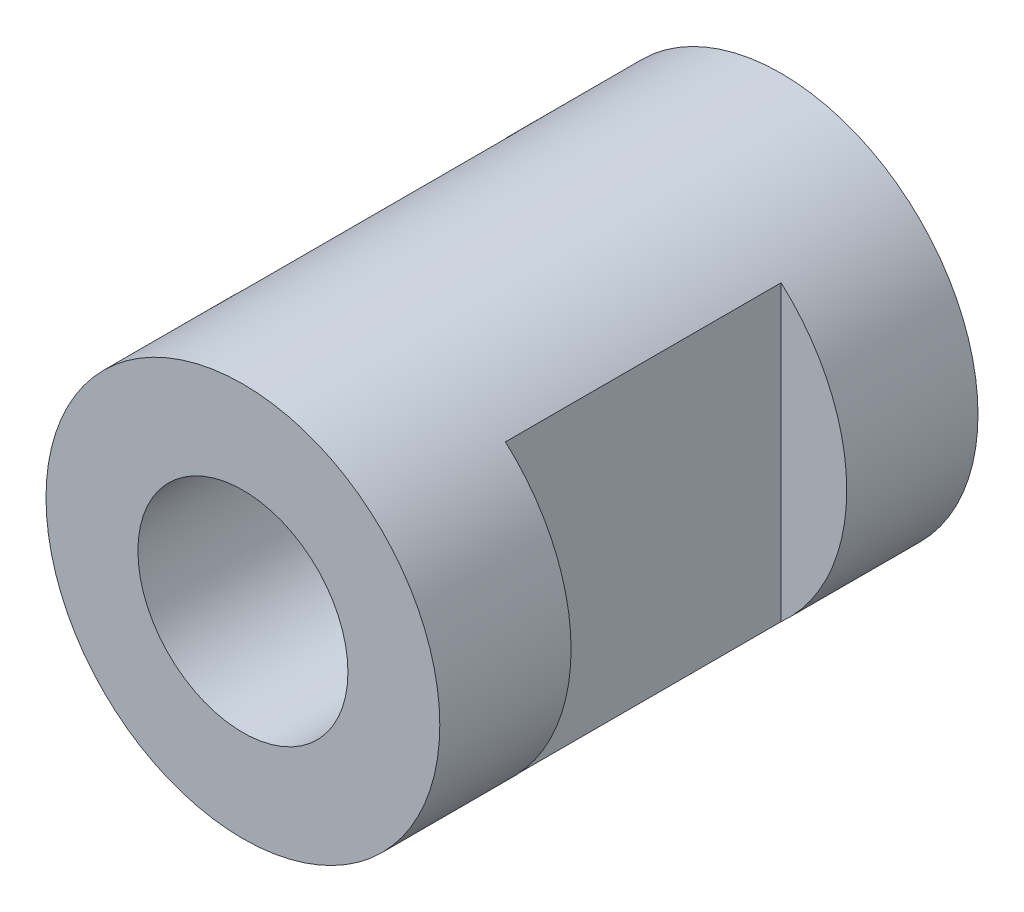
ISO-10303-21;
HEADER;
FILE_DESCRIPTION(('STEP AP214'),'2;1');
FILE_NAME('part.step','',(''),(''),'','','');
FILE_SCHEMA(('AUTOMOTIVE_DESIGN { 1 0 10303 214 1 1 1 1 }'));
ENDSEC;
DATA;
#1=APPLICATION_CONTEXT('core data for automotive mechanical design processes');
#2=APPLICATION_PROTOCOL_DEFINITION('international standard','automotive_design',2000,#1);
#3=PRODUCT_CONTEXT('',#1,'mechanical');
#4=PRODUCT('Part','Part','',(#3));
#5=PRODUCT_RELATED_PRODUCT_CATEGORY('part','',(#4));
#6=PRODUCT_DEFINITION_FORMATION('','',#4);
#7=PRODUCT_DEFINITION_CONTEXT('part definition',#1,'design');
#8=PRODUCT_DEFINITION('design','',#6,#7);
#9=PRODUCT_DEFINITION_SHAPE('','',#8);
#10=(LENGTH_UNIT() NAMED_UNIT(*) SI_UNIT(.MILLI.,.METRE.));
#11=(NAMED_UNIT(*) PLANE_ANGLE_UNIT() SI_UNIT($,.RADIAN.));
#12=(NAMED_UNIT(*) SI_UNIT($,.STERADIAN.) SOLID_ANGLE_UNIT());
#13=UNCERTAINTY_MEASURE_WITH_UNIT(LENGTH_MEASURE(1.E-05),#10,'distance_accuracy_value','');
#14=(GEOMETRIC_REPRESENTATION_CONTEXT(3) GLOBAL_UNCERTAINTY_ASSIGNED_CONTEXT((#13)) GLOBAL_UNIT_ASSIGNED_CONTEXT((#10,
#11,#12)) REPRESENTATION_CONTEXT('',''));
#15=CARTESIAN_POINT('',(0.,0.,0.));
#16=DIRECTION('',(0.,0.,1.));
#17=DIRECTION('',(1.,0.,0.));
#18=AXIS2_PLACEMENT_3D('',#15,#16,#17);
#19=CARTESIAN_POINT('',(0.,0.,20.5));
#20=DIRECTION('',(0.,0.,-1.));
#21=DIRECTION('',(-1.,0.,0.));
#22=AXIS2_PLACEMENT_3D('',#19,#20,#21);
#23=CYLINDRICAL_SURFACE('',#22,7.5);
#24=DIRECTION('',(0.,0.,-1.));
#25=VECTOR('',#24,1.);
#26=CARTESIAN_POINT('',(-5.,-5.59016994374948,20.5));
#27=LINE('',#26,#25);
#28=CARTESIAN_POINT('',(-5.,-5.59016994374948,15.5));
#29=VERTEX_POINT('',#28);
#30=CARTESIAN_POINT('',(-5.,-5.59016994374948,5.));
#31=VERTEX_POINT('',#30);
#32=EDGE_CURVE('E39',#29,#31,#27,.T.);
#33=ORIENTED_EDGE('',*,*,#32,.T.);
#34=CARTESIAN_POINT('',(0.,0.,5.));
#35=DIRECTION('',(0.,0.,-1.));
#36=DIRECTION('',(-1.,0.,0.));
#37=AXIS2_PLACEMENT_3D('',#34,#35,#36);
#38=CIRCLE('',#37,7.5);
#39=CARTESIAN_POINT('',(-5.,5.59016994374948,5.));
#40=VERTEX_POINT('',#39);
#41=EDGE_CURVE('E11',#31,#40,#38,.T.);
#42=ORIENTED_EDGE('',*,*,#41,.T.);
#43=DIRECTION('',(0.,0.,-1.));
#44=VECTOR('',#43,1.);
#45=CARTESIAN_POINT('',(-5.,5.59016994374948,20.5));
#46=LINE('',#45,#44);
#47=CARTESIAN_POINT('',(-5.,5.59016994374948,15.5));
#48=VERTEX_POINT('',#47);
#49=EDGE_CURVE('E75',#40,#48,#46,.F.);
#50=ORIENTED_EDGE('',*,*,#49,.T.);
#51=CARTESIAN_POINT('',(0.,0.,15.5));
#52=DIRECTION('',(0.,0.,1.));
#53=DIRECTION('',(1.,0.,0.));
#54=AXIS2_PLACEMENT_3D('',#51,#52,#53);
#55=CIRCLE('',#54,7.5);
#56=EDGE_CURVE('E70',#48,#29,#55,.T.);
#57=ORIENTED_EDGE('',*,*,#56,.T.);
#58=EDGE_LOOP('',(#33,#42,#50,#57));
#59=FACE_BOUND('',#58,.T.);
#60=DIRECTION('',(0.,0.,-1.));
#61=VECTOR('',#60,1.);
#62=CARTESIAN_POINT('',(5.,-5.59016994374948,20.5));
#63=LINE('',#62,#61);
#64=CARTESIAN_POINT('',(5.,-5.59016994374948,5.));
#65=VERTEX_POINT('',#64);
#66=CARTESIAN_POINT('',(5.,-5.59016994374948,15.5));
#67=VERTEX_POINT('',#66);
#68=EDGE_CURVE('E93',#65,#67,#63,.F.);
#69=ORIENTED_EDGE('',*,*,#68,.T.);
#70=CARTESIAN_POINT('',(0.,0.,15.5));
#71=DIRECTION('',(0.,0.,1.));
#72=DIRECTION('',(1.,0.,0.));
#73=AXIS2_PLACEMENT_3D('',#70,#71,#72);
#74=CIRCLE('',#73,7.5);
#75=CARTESIAN_POINT('',(5.,5.59016994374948,15.5));
#76=VERTEX_POINT('',#75);
#77=EDGE_CURVE('E76',#67,#76,#74,.T.);
#78=ORIENTED_EDGE('',*,*,#77,.T.);
#79=DIRECTION('',(0.,0.,-1.));
#80=VECTOR('',#79,1.);
#81=CARTESIAN_POINT('',(5.,5.59016994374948,20.5));
#82=LINE('',#81,#80);
#83=CARTESIAN_POINT('',(5.,5.59016994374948,5.));
#84=VERTEX_POINT('',#83);
#85=EDGE_CURVE('E90',#76,#84,#82,.T.);
#86=ORIENTED_EDGE('',*,*,#85,.T.);
#87=CARTESIAN_POINT('',(0.,0.,5.));
#88=DIRECTION('',(0.,0.,-1.));
#89=DIRECTION('',(-1.,0.,0.));
#90=AXIS2_PLACEMENT_3D('',#87,#88,#89);
#91=CIRCLE('',#90,7.5);
#92=EDGE_CURVE('E96',#84,#65,#91,.T.);
#93=ORIENTED_EDGE('',*,*,#92,.T.);
#94=EDGE_LOOP('',(#69,#78,#86,#93));
#95=FACE_BOUND('',#94,.T.);
#96=CARTESIAN_POINT('',(0.,0.,20.5));
#97=DIRECTION('',(0.,0.,1.));
#98=DIRECTION('',(1.,0.,0.));
#99=AXIS2_PLACEMENT_3D('',#96,#97,#98);
#100=CIRCLE('',#99,7.5);
#101=CARTESIAN_POINT('',(7.5,0.,20.5));
#102=VERTEX_POINT('',#101);
#103=EDGE_CURVE('E99',#102,#102,#100,.T.);
#104=ORIENTED_EDGE('',*,*,#103,.F.);
#105=EDGE_LOOP('',(#104));
#106=FACE_BOUND('',#105,.T.);
#107=CARTESIAN_POINT('',(0.,0.,0.));
#108=DIRECTION('',(0.,0.,1.));
#109=DIRECTION('',(1.,0.,0.));
#110=AXIS2_PLACEMENT_3D('',#107,#108,#109);
#111=CIRCLE('',#110,7.5);
#112=CARTESIAN_POINT('',(7.5,0.,0.));
#113=VERTEX_POINT('',#112);
#114=EDGE_CURVE('E100',#113,#113,#111,.T.);
#115=ORIENTED_EDGE('',*,*,#114,.T.);
#116=EDGE_LOOP('',(#115));
#117=FACE_BOUND('',#116,.T.);
#118=ADVANCED_FACE('F32',(#59,#95,#106,#117),#23,.T.);
#119=CARTESIAN_POINT('',(0.,0.,20.5));
#120=DIRECTION('',(0.,0.,1.));
#121=DIRECTION('',(1.,0.,0.));
#122=AXIS2_PLACEMENT_3D('',#119,#120,#121);
#123=PLANE('',#122);
#124=CARTESIAN_POINT('',(0.,0.,20.5));
#125=DIRECTION('',(0.,0.,-1.));
#126=DIRECTION('',(-1.,0.,0.));
#127=AXIS2_PLACEMENT_3D('',#124,#125,#126);
#128=CIRCLE('',#127,4.);
#129=CARTESIAN_POINT('',(-4.,0.,20.5));
#130=VERTEX_POINT('',#129);
#131=EDGE_CURVE('E83',#130,#130,#128,.T.);
#132=ORIENTED_EDGE('',*,*,#131,.T.);
#133=EDGE_LOOP('',(#132));
#134=FACE_BOUND('',#133,.T.);
#135=ORIENTED_EDGE('',*,*,#103,.T.);
#136=EDGE_LOOP('',(#135));
#137=FACE_BOUND('',#136,.T.);
#138=ADVANCED_FACE('F116',(#134,#137),#123,.T.);
#139=CARTESIAN_POINT('',(0.,0.,0.));
#140=DIRECTION('',(0.,0.,1.));
#141=DIRECTION('',(1.,0.,0.));
#142=AXIS2_PLACEMENT_3D('',#139,#140,#141);
#143=PLANE('',#142);
#144=CARTESIAN_POINT('',(0.,0.,0.));
#145=DIRECTION('',(0.,0.,-1.));
#146=DIRECTION('',(-1.,0.,0.));
#147=AXIS2_PLACEMENT_3D('',#144,#145,#146);
#148=CIRCLE('',#147,4.);
#149=CARTESIAN_POINT('',(-4.,0.,0.));
#150=VERTEX_POINT('',#149);
#151=EDGE_CURVE('E110',#150,#150,#148,.T.);
#152=ORIENTED_EDGE('',*,*,#151,.F.);
#153=EDGE_LOOP('',(#152));
#154=FACE_BOUND('',#153,.T.);
#155=ORIENTED_EDGE('',*,*,#114,.F.);
#156=EDGE_LOOP('',(#155));
#157=FACE_BOUND('',#156,.T.);
#158=ADVANCED_FACE('F125',(#154,#157),#143,.F.);
#159=CARTESIAN_POINT('',(9.63567721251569,-10.5,15.5));
#160=DIRECTION('',(0.,0.,1.));
#161=DIRECTION('',(1.,0.,0.));
#162=AXIS2_PLACEMENT_3D('',#159,#160,#161);
#163=PLANE('',#162);
#164=DIRECTION('',(0.,1.,0.));
#165=VECTOR('',#164,1.);
#166=CARTESIAN_POINT('',(5.,-10.5,15.5));
#167=LINE('',#166,#165);
#168=EDGE_CURVE('E103',#67,#76,#167,.T.);
#169=ORIENTED_EDGE('',*,*,#168,.T.);
#170=ORIENTED_EDGE('',*,*,#77,.F.);
#171=EDGE_LOOP('',(#169,#170));
#172=FACE_BOUND('',#171,.T.);
#173=ADVANCED_FACE('F128',(#172),#163,.F.);
#174=CARTESIAN_POINT('',(5.,-10.5,15.5));
#175=DIRECTION('',(-1.,0.,0.));
#176=DIRECTION('',(0.,0.,1.));
#177=AXIS2_PLACEMENT_3D('',#174,#175,#176);
#178=PLANE('',#177);
#179=ORIENTED_EDGE('',*,*,#168,.F.);
#180=ORIENTED_EDGE('',*,*,#68,.F.);
#181=DIRECTION('',(0.,1.,0.));
#182=VECTOR('',#181,1.);
#183=CARTESIAN_POINT('',(5.,-10.5,5.));
#184=LINE('',#183,#182);
#185=EDGE_CURVE('E52',#65,#84,#184,.T.);
#186=ORIENTED_EDGE('',*,*,#185,.T.);
#187=ORIENTED_EDGE('',*,*,#85,.F.);
#188=EDGE_LOOP('',(#179,#180,#186,#187));
#189=FACE_BOUND('',#188,.T.);
#190=ADVANCED_FACE('F143',(#189),#178,.F.);
#191=CARTESIAN_POINT('',(9.63567721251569,-10.5,5.));
#192=DIRECTION('',(0.,0.,-1.));
#193=DIRECTION('',(-1.,0.,0.));
#194=AXIS2_PLACEMENT_3D('',#191,#192,#193);
#195=PLANE('',#194);
#196=ORIENTED_EDGE('',*,*,#185,.F.);
#197=ORIENTED_EDGE('',*,*,#92,.F.);
#198=EDGE_LOOP('',(#196,#197));
#199=FACE_BOUND('',#198,.T.);
#200=ADVANCED_FACE('F139',(#199),#195,.F.);
#201=CARTESIAN_POINT('',(-9.63567721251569,-10.5,5.));
#202=DIRECTION('',(0.,0.,-1.));
#203=DIRECTION('',(-1.,0.,0.));
#204=AXIS2_PLACEMENT_3D('',#201,#202,#203);
#205=PLANE('',#204);
#206=DIRECTION('',(0.,1.,0.));
#207=VECTOR('',#206,1.);
#208=CARTESIAN_POINT('',(-5.,-10.5,5.));
#209=LINE('',#208,#207);
#210=EDGE_CURVE('E82',#31,#40,#209,.T.);
#211=ORIENTED_EDGE('',*,*,#210,.T.);
#212=ORIENTED_EDGE('',*,*,#41,.F.);
#213=EDGE_LOOP('',(#211,#212));
#214=FACE_BOUND('',#213,.T.);
#215=ADVANCED_FACE('F142',(#214),#205,.F.);
#216=CARTESIAN_POINT('',(-5.,-10.5,15.5));
#217=DIRECTION('',(1.,0.,0.));
#218=DIRECTION('',(0.,0.,-1.));
#219=AXIS2_PLACEMENT_3D('',#216,#217,#218);
#220=PLANE('',#219);
#221=DIRECTION('',(0.,1.,0.));
#222=VECTOR('',#221,1.);
#223=CARTESIAN_POINT('',(-5.,-10.5,15.5));
#224=LINE('',#223,#222);
#225=EDGE_CURVE('E45',#29,#48,#224,.T.);
#226=ORIENTED_EDGE('',*,*,#225,.T.);
#227=ORIENTED_EDGE('',*,*,#49,.F.);
#228=ORIENTED_EDGE('',*,*,#210,.F.);
#229=ORIENTED_EDGE('',*,*,#32,.F.);
#230=EDGE_LOOP('',(#226,#227,#228,#229));
#231=FACE_BOUND('',#230,.T.);
#232=ADVANCED_FACE('F79',(#231),#220,.F.);
#233=CARTESIAN_POINT('',(-9.63567721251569,-10.5,15.5));
#234=DIRECTION('',(0.,0.,1.));
#235=DIRECTION('',(1.,0.,0.));
#236=AXIS2_PLACEMENT_3D('',#233,#234,#235);
#237=PLANE('',#236);
#238=ORIENTED_EDGE('',*,*,#225,.F.);
#239=ORIENTED_EDGE('',*,*,#56,.F.);
#240=EDGE_LOOP('',(#238,#239));
#241=FACE_BOUND('',#240,.T.);
#242=ADVANCED_FACE('F71',(#241),#237,.F.);
#243=CARTESIAN_POINT('',(0.,0.,20.5));
#244=DIRECTION('',(0.,0.,-1.));
#245=DIRECTION('',(-1.,0.,0.));
#246=AXIS2_PLACEMENT_3D('',#243,#244,#245);
#247=CYLINDRICAL_SURFACE('',#246,4.);
#248=ORIENTED_EDGE('',*,*,#131,.F.);
#249=EDGE_LOOP('',(#248));
#250=FACE_BOUND('',#249,.T.);
#251=ORIENTED_EDGE('',*,*,#151,.T.);
#252=EDGE_LOOP('',(#251));
#253=FACE_BOUND('',#252,.T.);
#254=ADVANCED_FACE('F119',(#250,#253),#247,.F.);
#255=CLOSED_SHELL('',(#118,#138,#158,#173,#190,#200,#215,#232,#242,#254));
#256=MANIFOLD_SOLID_BREP('B2',#255);
#257=ADVANCED_BREP_SHAPE_REPRESENTATION('',(#18,#256),#14);
#258=SHAPE_DEFINITION_REPRESENTATION(#9,#257);
ENDSEC;
END-ISO-10303-21;
